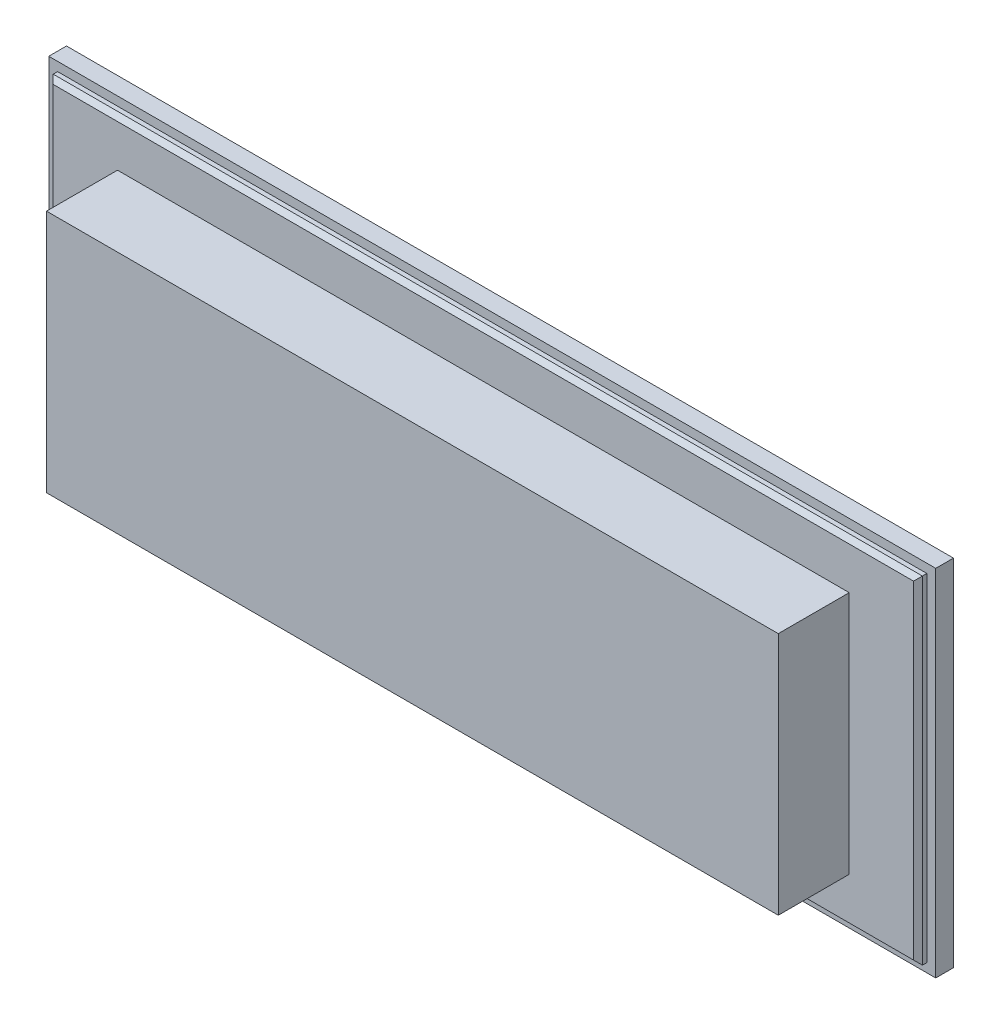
from build123d import *

# Parameters (mm, degrees)
SKIZZE1_W                       = 200
SKIZZE1_H                       = 80
AUFSATZ_LINEAR_AUSTRAGEN1_DEPTH = 4
SKIZZE2_W                       = 196
SKIZZE2_H                       = 76
AUFSATZ_LINEAR_AUSTRAGEN2_DEPTH = 2
FASE1_SIZE                      = 1
SKIZZE3_W                       = 165
SKIZZE3_H                       = 55
AUFSATZ_LINEAR_AUSTRAGEN3_DEPTH = 16


with BuildPart() as part:
    # Skizze1 → Aufsatz-Linear austragen1 (new body)
    with BuildSketch(Plane.XY):
        Rectangle(SKIZZE1_W, SKIZZE1_H)
    extrude(amount=AUFSATZ_LINEAR_AUSTRAGEN1_DEPTH)

    # Skizze2 → Aufsatz-Linear austragen2 (add)
    with BuildSketch(Plane.XY.offset(4)):
        Rectangle(SKIZZE2_W, SKIZZE2_H)
    extrude(amount=AUFSATZ_LINEAR_AUSTRAGEN2_DEPTH)

    # Fase1
    fase1_edges = [part.edges().sort_by_distance(p)[0] for p in [
        (98, 0, 6),
        (0, 38, 6),
        (-98, 0, 6),
        (0, -38, 6),
    ]]
    chamfer(fase1_edges, length=FASE1_SIZE)

    # Skizze3 → Aufsatz-Linear austragen3 (add)
    with BuildSketch(Plane.XY.offset(6)):
        Rectangle(SKIZZE3_W, SKIZZE3_H)
    extrude(amount=AUFSATZ_LINEAR_AUSTRAGEN3_DEPTH)


solid = part.part
